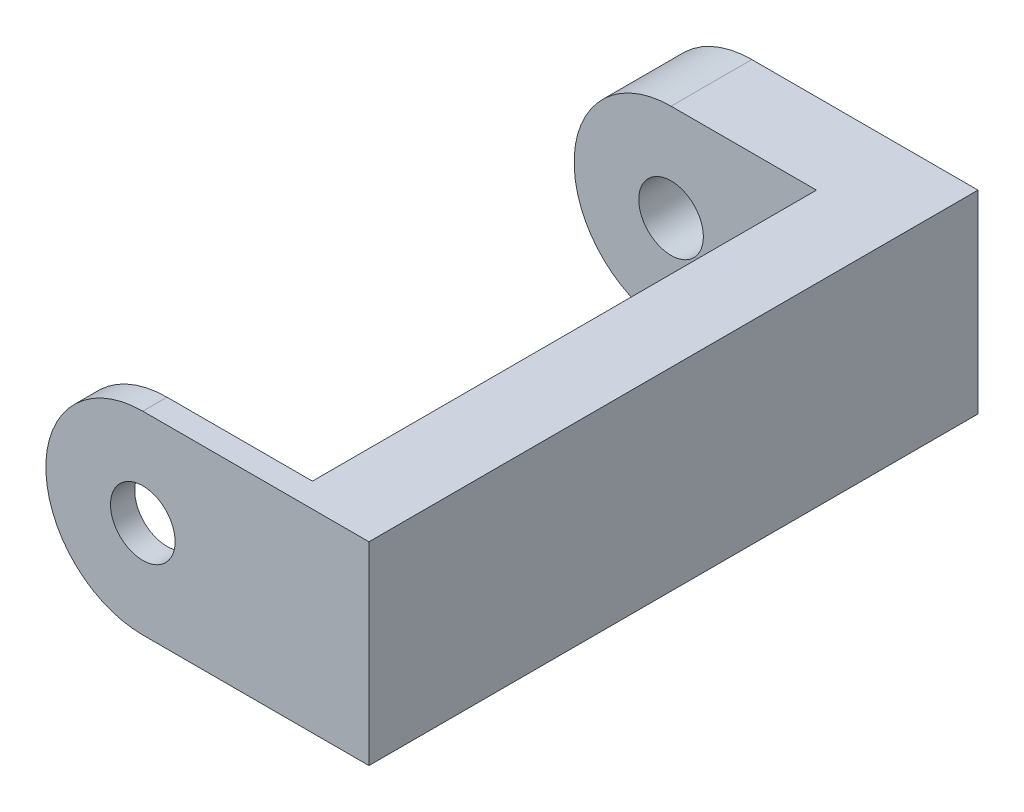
from build123d import *

# Parameters (mm, degrees)
BOSS_EXTRUDE3_DEPTH       = 75.4
SKETCH3_W                 = 40.663621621
SKETCH3_H                 = 62.4
CUT_EXTRUDE1_DEPTH        = 75.4
F_8_0MM_DOWEL_HOLE2_D     = 8
F_8_0MM_DOWEL_HOLE2_DEPTH = 3
F_8_0MM_DOWEL_HOLE2_TIP   = 2.403442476
F_8_0MM_DOWEL_HOLE1_D     = 8


with BuildPart() as part:
    # Sketch2 → Boss-Extrude3 (new body)
    with BuildSketch(Plane.XY):
        with BuildLine():
            Line((0, 12), (28, 12))
            Line((28, 12), (28, -12))
            Line((28, -12), (0, -12))
            ThreePointArc((0, -12), (-12, 0), (0, 12))
        make_face()
    extrude(amount=BOSS_EXTRUDE3_DEPTH)

    # Sketch3 → Cut-Extrude1 (cut)
    with BuildSketch(Plane.XZ.offset(12)):
        with Locations((-2.331810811, 41.2)):
            Rectangle(SKETCH3_W, SKETCH3_H)
    extrude(amount=-CUT_EXTRUDE1_DEPTH, mode=Mode.SUBTRACT)

    # 8.0mm Dowel Hole2
    with Locations(Plane.XY.offset(75.4)):
        with Locations((0, 0)):
            Hole(F_8_0MM_DOWEL_HOLE2_D / 2, depth=F_8_0MM_DOWEL_HOLE2_DEPTH)
            with Locations((0, 0, -(F_8_0MM_DOWEL_HOLE2_DEPTH + F_8_0MM_DOWEL_HOLE2_TIP / 2))):  # 118° drill point
                Cone(0, F_8_0MM_DOWEL_HOLE2_D / 2, F_8_0MM_DOWEL_HOLE2_TIP, mode=Mode.SUBTRACT)

    # 8.0mm Dowel Hole1 (through all)
    with Locations(Plane.XY.offset(10)):
        with Locations((0, 0)):
            Hole(F_8_0MM_DOWEL_HOLE1_D / 2)


solid = part.part
